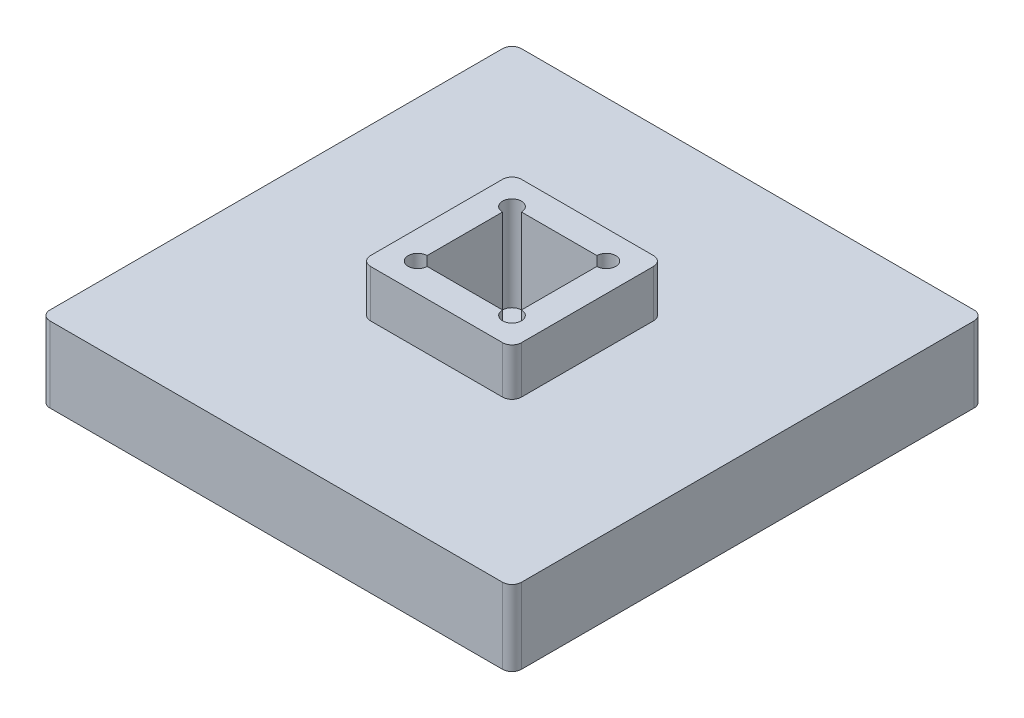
from build123d import *
from build123d.topology import SkipClean

# Parameters (mm, degrees)
SKETCH_1_W          = 50
SKETCH_1_H          = 50
EXTRUDE_1_DEPTH     = 8
SKETCH_2_W          = 16
SKETCH_2_H          = 16
EXTRUDE_2_DEPTH     = 5
FILLET_1_R          = 1
CUT_EXTRUDE_START   = -5
CUT_EXTRUDE_1_DEPTH = 5


with BuildPart() as part:
    # Sketch 1 → Extrude 1 (new body)
    with BuildSketch(Plane(origin=(0, 0, 0), x_dir=(1, 0, 0), z_dir=(0, 1, 0))):
        Rectangle(SKETCH_1_W, SKETCH_1_H)
    extrude(amount=EXTRUDE_1_DEPTH)

    # Sketch 2 → Extrude 2 (add)
    with BuildSketch(Plane(origin=(0, 8, 0), x_dir=(1, 0, 0), z_dir=(0, 1, 0))):
        Rectangle(SKETCH_2_W, SKETCH_2_H)
        with BuildLine():
            Line((4, -5), (-4, -5))
            ThreePointArc((-4, -5), (-5.707106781, -5.707106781), (-5, -4))
            Line((-5, -4), (-5, 4))
            ThreePointArc((-5, 4), (-5.707106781, 5.707106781), (-4, 5))
            Line((-4, 5), (4, 5))
            ThreePointArc((4, 5), (5, 6), (6, 5))
            ThreePointArc((6, 5), (5.707106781, 4.292893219), (5, 4))
            Line((5, 4), (5, -4))
            ThreePointArc((5, -4), (5.707106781, -4.292893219), (6, -5))
            ThreePointArc((6, -5), (5, -6), (4, -5))
        make_face(mode=Mode.SUBTRACT)
    extrude(amount=EXTRUDE_2_DEPTH)

    # Fillet 1
    fillet_1_edges = [part.edges().sort_by_distance(p)[0] for p in [
        (-8, 10.5, 8),
        (8, 10.5, 8),
        (8, 10.5, -8),
        (-8, 10.5, -8),
        (25, 4, 25),
        (-25, 4, 25),
        (-25, 4, -25),
        (25, 4, -25),
    ]]
    fillet(fillet_1_edges, radius=FILLET_1_R)

    # Sketch 3 → Cut-Extrude 1 (cut)
    with SkipClean():  # the faces are left unmerged after this step: merging them gives an invalid solid
        with BuildSketch(Plane(origin=(0, 8, 0), x_dir=(1, 0, 0), z_dir=(0, 1, 0)).offset(CUT_EXTRUDE_START)):
            with BuildLine():
                Line((-5, 4), (-5, -4))
                ThreePointArc((-5, -4), (-5.707106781, -5.707106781), (-4, -5))
                Line((-4, -5), (4, -5))
                ThreePointArc((4, -5), (5.707106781, -5.707106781), (5, -4))
                Line((5, -4), (5, 4))
                ThreePointArc((5, 4), (5.707106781, 5.707106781), (4, 5))
                Line((4, 5), (-4, 5))
                ThreePointArc((-4, 5), (-5.707106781, 5.707106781), (-5, 4))
            make_face()
        extrude(amount=CUT_EXTRUDE_1_DEPTH, mode=Mode.SUBTRACT)


solid = part.part
